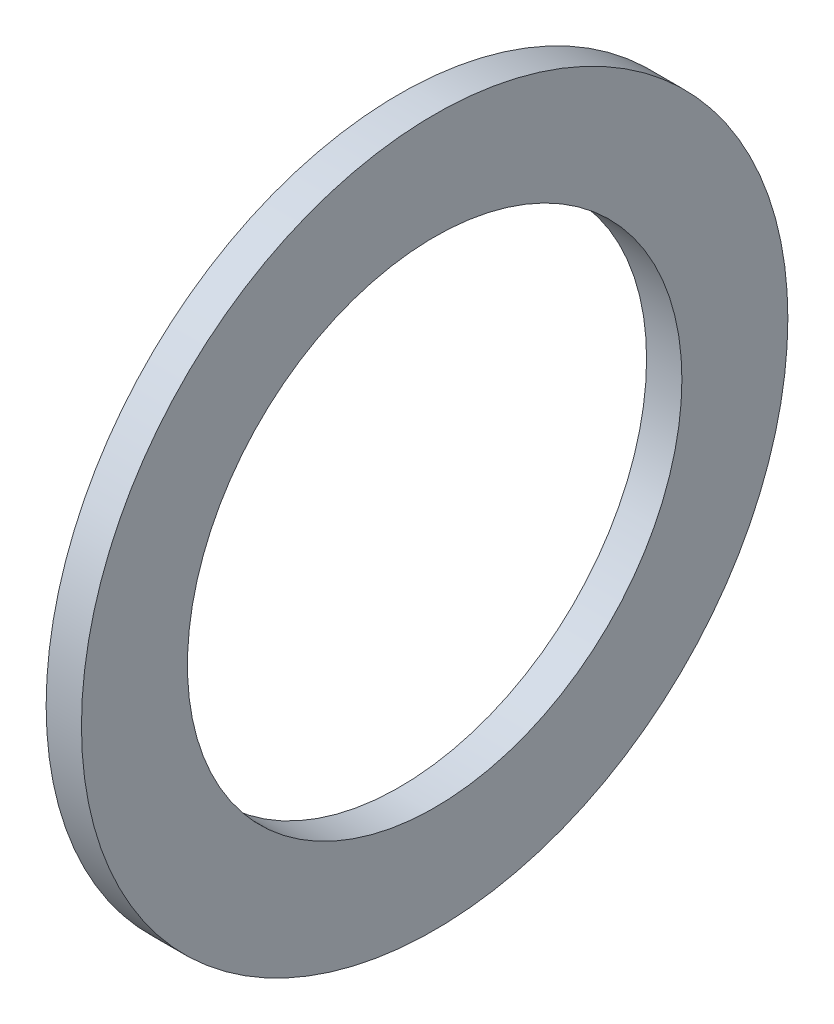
ISO-10303-21;
HEADER;
FILE_DESCRIPTION(('STEP AP214'),'2;1');
FILE_NAME('part.step','',(''),(''),'','','');
FILE_SCHEMA(('AUTOMOTIVE_DESIGN { 1 0 10303 214 1 1 1 1 }'));
ENDSEC;
DATA;
#1=APPLICATION_CONTEXT('core data for automotive mechanical design processes');
#2=APPLICATION_PROTOCOL_DEFINITION('international standard','automotive_design',2000,#1);
#3=PRODUCT_CONTEXT('',#1,'mechanical');
#4=PRODUCT('Part','Part','',(#3));
#5=PRODUCT_RELATED_PRODUCT_CATEGORY('part','',(#4));
#6=PRODUCT_DEFINITION_FORMATION('','',#4);
#7=PRODUCT_DEFINITION_CONTEXT('part definition',#1,'design');
#8=PRODUCT_DEFINITION('design','',#6,#7);
#9=PRODUCT_DEFINITION_SHAPE('','',#8);
#10=(LENGTH_UNIT() NAMED_UNIT(*) SI_UNIT(.MILLI.,.METRE.));
#11=(NAMED_UNIT(*) PLANE_ANGLE_UNIT() SI_UNIT($,.RADIAN.));
#12=(NAMED_UNIT(*) SI_UNIT($,.STERADIAN.) SOLID_ANGLE_UNIT());
#13=UNCERTAINTY_MEASURE_WITH_UNIT(LENGTH_MEASURE(1.E-05),#10,'distance_accuracy_value','');
#14=(GEOMETRIC_REPRESENTATION_CONTEXT(3) GLOBAL_UNCERTAINTY_ASSIGNED_CONTEXT((#13)) GLOBAL_UNIT_ASSIGNED_CONTEXT((#10,
#11,#12)) REPRESENTATION_CONTEXT('',''));
#15=CARTESIAN_POINT('',(0.,0.,0.));
#16=DIRECTION('',(0.,0.,1.));
#17=DIRECTION('',(1.,0.,0.));
#18=AXIS2_PLACEMENT_3D('',#15,#16,#17);
#19=CARTESIAN_POINT('',(-0.499999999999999,-5.,0.));
#20=DIRECTION('',(1.,0.,0.));
#21=DIRECTION('',(0.,0.,-1.));
#22=AXIS2_PLACEMENT_3D('',#19,#20,#21);
#23=PLANE('',#22);
#24=CARTESIAN_POINT('',(-0.499999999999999,0.,0.));
#25=DIRECTION('',(1.,0.,0.));
#26=DIRECTION('',(0.,0.,-1.));
#27=AXIS2_PLACEMENT_3D('',#24,#25,#26);
#28=CIRCLE('',#27,3.5);
#29=CARTESIAN_POINT('',(-0.499999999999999,0.,-3.5));
#30=VERTEX_POINT('',#29);
#31=EDGE_CURVE('E40',#30,#30,#28,.T.);
#32=ORIENTED_EDGE('',*,*,#31,.T.);
#33=EDGE_LOOP('',(#32));
#34=FACE_BOUND('',#33,.T.);
#35=CARTESIAN_POINT('',(-0.499999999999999,0.,0.));
#36=DIRECTION('',(1.,0.,0.));
#37=DIRECTION('',(0.,0.,-1.));
#38=AXIS2_PLACEMENT_3D('',#35,#36,#37);
#39=CIRCLE('',#38,5.);
#40=CARTESIAN_POINT('',(-0.499999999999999,0.,-5.));
#41=VERTEX_POINT('',#40);
#42=EDGE_CURVE('E10',#41,#41,#39,.T.);
#43=ORIENTED_EDGE('',*,*,#42,.F.);
#44=EDGE_LOOP('',(#43));
#45=FACE_BOUND('',#44,.T.);
#46=ADVANCED_FACE('F30',(#34,#45),#23,.F.);
#47=CARTESIAN_POINT('',(0.,0.,0.));
#48=DIRECTION('',(1.,0.,0.));
#49=DIRECTION('',(0.,0.,-1.));
#50=AXIS2_PLACEMENT_3D('',#47,#48,#49);
#51=CYLINDRICAL_SURFACE('',#50,5.);
#52=CARTESIAN_POINT('',(0.,0.,0.));
#53=DIRECTION('',(1.,0.,0.));
#54=DIRECTION('',(0.,0.,-1.));
#55=AXIS2_PLACEMENT_3D('',#52,#53,#54);
#56=CIRCLE('',#55,5.);
#57=CARTESIAN_POINT('',(0.,0.,-5.));
#58=VERTEX_POINT('',#57);
#59=EDGE_CURVE('E36',#58,#58,#56,.T.);
#60=ORIENTED_EDGE('',*,*,#59,.F.);
#61=EDGE_LOOP('',(#60));
#62=FACE_BOUND('',#61,.T.);
#63=ORIENTED_EDGE('',*,*,#42,.T.);
#64=EDGE_LOOP('',(#63));
#65=FACE_BOUND('',#64,.T.);
#66=ADVANCED_FACE('F55',(#62,#65),#51,.T.);
#67=CARTESIAN_POINT('',(0.,0.,0.));
#68=DIRECTION('',(-1.,0.,0.));
#69=DIRECTION('',(0.,0.,1.));
#70=AXIS2_PLACEMENT_3D('',#67,#68,#69);
#71=PLANE('',#70);
#72=CARTESIAN_POINT('',(0.,0.,0.));
#73=DIRECTION('',(1.,0.,0.));
#74=DIRECTION('',(0.,0.,-1.));
#75=AXIS2_PLACEMENT_3D('',#72,#73,#74);
#76=CIRCLE('',#75,3.5);
#77=CARTESIAN_POINT('',(0.,0.,-3.5));
#78=VERTEX_POINT('',#77);
#79=EDGE_CURVE('E44',#78,#78,#76,.T.);
#80=ORIENTED_EDGE('',*,*,#79,.F.);
#81=EDGE_LOOP('',(#80));
#82=FACE_BOUND('',#81,.T.);
#83=ORIENTED_EDGE('',*,*,#59,.T.);
#84=EDGE_LOOP('',(#83));
#85=FACE_BOUND('',#84,.T.);
#86=ADVANCED_FACE('F53',(#82,#85),#71,.F.);
#87=CARTESIAN_POINT('',(-10.,0.,0.));
#88=DIRECTION('',(1.,0.,0.));
#89=DIRECTION('',(0.,0.,-1.));
#90=AXIS2_PLACEMENT_3D('',#87,#88,#89);
#91=CYLINDRICAL_SURFACE('',#90,3.5);
#92=ORIENTED_EDGE('',*,*,#79,.T.);
#93=EDGE_LOOP('',(#92));
#94=FACE_BOUND('',#93,.T.);
#95=ORIENTED_EDGE('',*,*,#31,.F.);
#96=EDGE_LOOP('',(#95));
#97=FACE_BOUND('',#96,.T.);
#98=ADVANCED_FACE('F50',(#94,#97),#91,.F.);
#99=CLOSED_SHELL('',(#46,#66,#86,#98));
#100=MANIFOLD_SOLID_BREP('B2',#99);
#101=ADVANCED_BREP_SHAPE_REPRESENTATION('',(#18,#100),#14);
#102=SHAPE_DEFINITION_REPRESENTATION(#9,#101);
ENDSEC;
END-ISO-10303-21;
